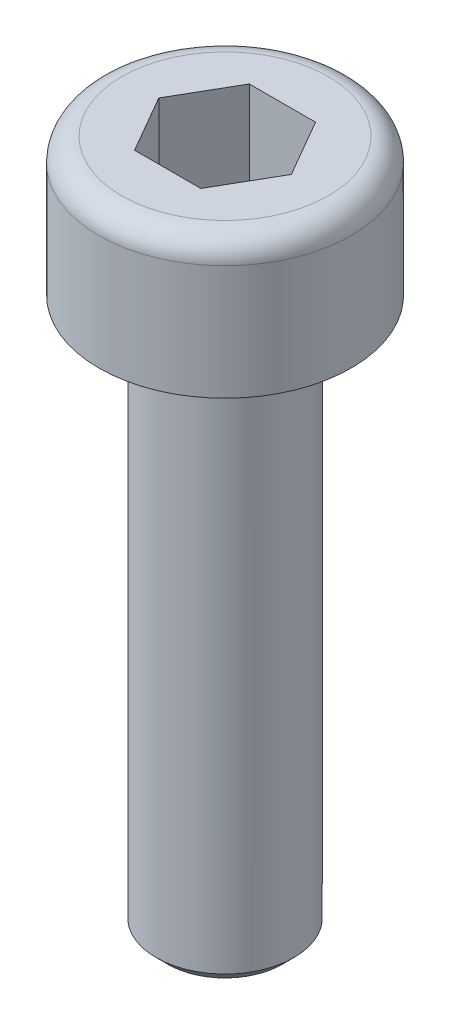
from build123d import *

# Parameters (mm, degrees)
ENL_V_MAT_EXTRU_1_DEPTH = 2
CHANFREIN1_SIZE         = 0.25


with BuildPart() as part:
    # Esquisse1 → Base-R_volution (revolve)
    with BuildSketch(Plane.XY, mode=Mode.PRIVATE) as base_r_volution_sk:
        with BuildLine():
            Line((0, 15), (-2.25, 15))
            ThreePointArc((-2.25, 15), (-2.603553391, 14.853553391), (-2.75, 14.5))
            Line((-2.75, 14.5), (-2.75, 12))
            Line((-2.75, 12), (-1.5, 12))
            Line((-1.5, 12), (-1.5, 0))
            Line((-1.5, 0), (0, 0))
            Line((0, 0), (0, 15))
        make_face()
    revolve(base_r_volution_sk.sketch.rotate(Axis((0, 16.088048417, 0), (0, -1, 0)), 270), axis=Axis((0, 16.088048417, 0), (0, -1, 0)))

    # Esquisse2 → Enl_v. mat.-Extru.1 (cut)
    with BuildSketch(Plane(origin=(0, 15, 0), x_dir=(-1, 0, 0), z_dir=(0, 1, 0))):
        Polygon((1.443375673, 0), (0.721687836, -1.25), (-0.721687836, -1.25), (-1.443375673, 0), (-0.721687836, 1.25), (0.721687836, 1.25), align=None)
    extrude(amount=-ENL_V_MAT_EXTRU_1_DEPTH, mode=Mode.SUBTRACT)

    # Chanfrein1
    chanfrein1_edges = [part.edges().sort_by_distance(p)[0] for p in [
        (0, 0, -1.5),
    ]]
    chamfer(chanfrein1_edges, length=CHANFREIN1_SIZE)


solid = part.part
